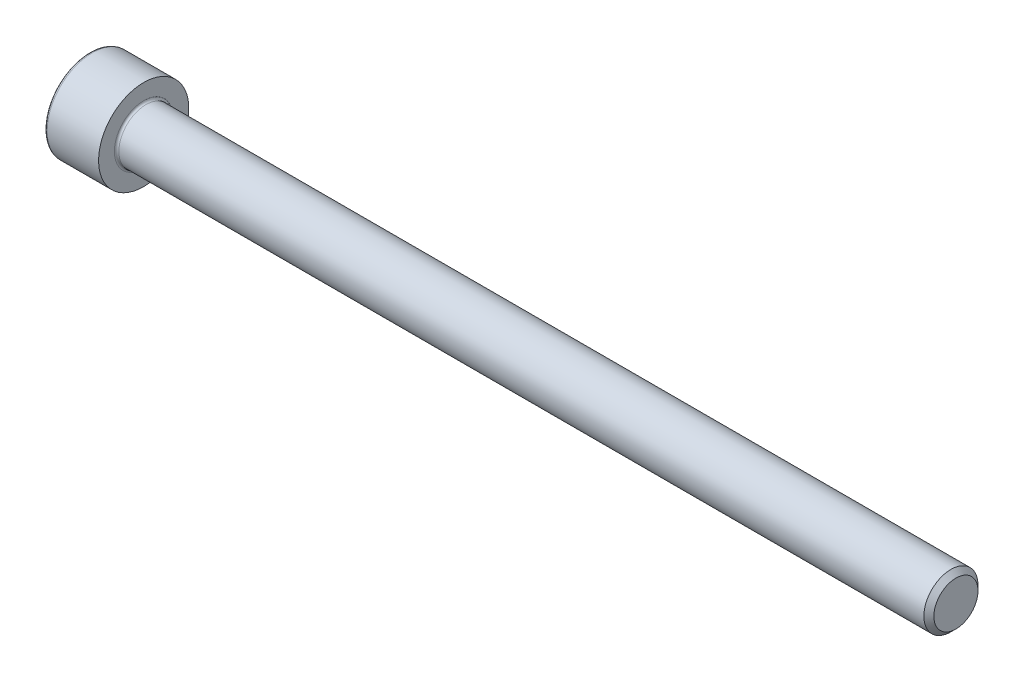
ISO-10303-21;
HEADER;
FILE_DESCRIPTION(('STEP AP214'),'2;1');
FILE_NAME('part.step','',(''),(''),'','','');
FILE_SCHEMA(('AUTOMOTIVE_DESIGN { 1 0 10303 214 1 1 1 1 }'));
ENDSEC;
DATA;
#1=APPLICATION_CONTEXT('core data for automotive mechanical design processes');
#2=APPLICATION_PROTOCOL_DEFINITION('international standard','automotive_design',2000,#1);
#3=PRODUCT_CONTEXT('',#1,'mechanical');
#4=PRODUCT('Part','Part','',(#3));
#5=PRODUCT_RELATED_PRODUCT_CATEGORY('part','',(#4));
#6=PRODUCT_DEFINITION_FORMATION('','',#4);
#7=PRODUCT_DEFINITION_CONTEXT('part definition',#1,'design');
#8=PRODUCT_DEFINITION('design','',#6,#7);
#9=PRODUCT_DEFINITION_SHAPE('','',#8);
#10=(LENGTH_UNIT() NAMED_UNIT(*) SI_UNIT(.MILLI.,.METRE.));
#11=(NAMED_UNIT(*) PLANE_ANGLE_UNIT() SI_UNIT($,.RADIAN.));
#12=(NAMED_UNIT(*) SI_UNIT($,.STERADIAN.) SOLID_ANGLE_UNIT());
#13=UNCERTAINTY_MEASURE_WITH_UNIT(LENGTH_MEASURE(1.E-05),#10,'distance_accuracy_value','');
#14=(GEOMETRIC_REPRESENTATION_CONTEXT(3) GLOBAL_UNCERTAINTY_ASSIGNED_CONTEXT((#13)) GLOBAL_UNIT_ASSIGNED_CONTEXT((#10,
#11,#12)) REPRESENTATION_CONTEXT('',''));
#15=CARTESIAN_POINT('',(0.,0.,0.));
#16=DIRECTION('',(0.,0.,1.));
#17=DIRECTION('',(1.,0.,0.));
#18=AXIS2_PLACEMENT_3D('',#15,#16,#17);
#19=CARTESIAN_POINT('',(0.,0.,0.));
#20=DIRECTION('',(-1.,0.,0.));
#21=DIRECTION('',(0.,0.,1.));
#22=AXIS2_PLACEMENT_3D('',#19,#20,#21);
#23=PLANE('',#22);
#24=DIRECTION('',(0.,-0.499999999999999,0.866025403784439));
#25=VECTOR('',#24,1.);
#26=CARTESIAN_POINT('',(0.,2.93524876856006,0.));
#27=LINE('',#26,#25);
#28=CARTESIAN_POINT('',(0.,2.93524876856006,0.));
#29=VERTEX_POINT('',#28);
#30=CARTESIAN_POINT('',(0.,1.46762438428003,2.542));
#31=VERTEX_POINT('',#30);
#32=EDGE_CURVE('E256',#29,#31,#27,.T.);
#33=ORIENTED_EDGE('',*,*,#32,.T.);
#34=DIRECTION('',(0.,1.,0.));
#35=VECTOR('',#34,1.);
#36=CARTESIAN_POINT('',(0.,-1.46762438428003,2.542));
#37=LINE('',#36,#35);
#38=CARTESIAN_POINT('',(0.,-1.46762438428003,2.542));
#39=VERTEX_POINT('',#38);
#40=EDGE_CURVE('E128',#39,#31,#37,.T.);
#41=ORIENTED_EDGE('',*,*,#40,.F.);
#42=DIRECTION('',(0.,-0.500000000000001,-0.866025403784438));
#43=VECTOR('',#42,1.);
#44=CARTESIAN_POINT('',(0.,-1.46762438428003,2.542));
#45=LINE('',#44,#43);
#46=CARTESIAN_POINT('',(0.,-2.93524876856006,0.));
#47=VERTEX_POINT('',#46);
#48=EDGE_CURVE('E259',#39,#47,#45,.T.);
#49=ORIENTED_EDGE('',*,*,#48,.T.);
#50=DIRECTION('',(0.,0.499999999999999,-0.866025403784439));
#51=VECTOR('',#50,1.);
#52=CARTESIAN_POINT('',(0.,-2.93524876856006,0.));
#53=LINE('',#52,#51);
#54=CARTESIAN_POINT('',(0.,-1.46762438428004,-2.542));
#55=VERTEX_POINT('',#54);
#56=EDGE_CURVE('E262',#47,#55,#53,.T.);
#57=ORIENTED_EDGE('',*,*,#56,.T.);
#58=DIRECTION('',(0.,-1.,0.));
#59=VECTOR('',#58,1.);
#60=CARTESIAN_POINT('',(0.,1.46762438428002,-2.54200000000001));
#61=LINE('',#60,#59);
#62=CARTESIAN_POINT('',(0.,1.46762438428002,-2.54200000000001));
#63=VERTEX_POINT('',#62);
#64=EDGE_CURVE('E265',#63,#55,#61,.T.);
#65=ORIENTED_EDGE('',*,*,#64,.F.);
#66=DIRECTION('',(0.,-0.500000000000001,-0.866025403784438));
#67=VECTOR('',#66,1.);
#68=CARTESIAN_POINT('',(0.,2.93524876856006,0.));
#69=LINE('',#68,#67);
#70=EDGE_CURVE('E123',#29,#63,#69,.T.);
#71=ORIENTED_EDGE('',*,*,#70,.F.);
#72=EDGE_LOOP('',(#33,#41,#49,#57,#65,#71));
#73=FACE_BOUND('',#72,.T.);
#74=CARTESIAN_POINT('',(0.,0.,0.));
#75=DIRECTION('',(-1.,0.,0.));
#76=DIRECTION('',(0.,0.,1.));
#77=AXIS2_PLACEMENT_3D('',#74,#75,#76);
#78=CIRCLE('',#77,4.7);
#79=CARTESIAN_POINT('',(0.,0.,4.7));
#80=VERTEX_POINT('',#79);
#81=EDGE_CURVE('E40',#80,#80,#78,.T.);
#82=ORIENTED_EDGE('',*,*,#81,.T.);
#83=EDGE_LOOP('',(#82));
#84=FACE_BOUND('',#83,.T.);
#85=ADVANCED_FACE('F32',(#73,#84),#23,.T.);
#86=CARTESIAN_POINT('',(-31.75,0.,0.));
#87=DIRECTION('',(-1.,0.,0.));
#88=DIRECTION('',(0.,0.,1.));
#89=AXIS2_PLACEMENT_3D('',#86,#87,#88);
#90=CYLINDRICAL_SURFACE('',#89,5.);
#91=CARTESIAN_POINT('',(0.300000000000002,0.,0.));
#92=DIRECTION('',(-1.,0.,0.));
#93=DIRECTION('',(0.,0.,1.));
#94=AXIS2_PLACEMENT_3D('',#91,#92,#93);
#95=CIRCLE('',#94,5.);
#96=CARTESIAN_POINT('',(0.300000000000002,0.,5.));
#97=VERTEX_POINT('',#96);
#98=EDGE_CURVE('E11',#97,#97,#95,.F.);
#99=ORIENTED_EDGE('',*,*,#98,.T.);
#100=EDGE_LOOP('',(#99));
#101=FACE_BOUND('',#100,.T.);
#102=CARTESIAN_POINT('',(6.,0.,0.));
#103=DIRECTION('',(-1.,0.,0.));
#104=DIRECTION('',(0.,0.,1.));
#105=AXIS2_PLACEMENT_3D('',#102,#103,#104);
#106=CIRCLE('',#105,5.);
#107=CARTESIAN_POINT('',(6.,0.,5.));
#108=VERTEX_POINT('',#107);
#109=EDGE_CURVE('E146',#108,#108,#106,.T.);
#110=ORIENTED_EDGE('',*,*,#109,.T.);
#111=EDGE_LOOP('',(#110));
#112=FACE_BOUND('',#111,.T.);
#113=ADVANCED_FACE('F170',(#101,#112),#90,.T.);
#114=CARTESIAN_POINT('',(6.,5.,0.));
#115=DIRECTION('',(1.,0.,0.));
#116=DIRECTION('',(0.,0.,-1.));
#117=AXIS2_PLACEMENT_3D('',#114,#115,#116);
#118=PLANE('',#117);
#119=CARTESIAN_POINT('',(6.,0.,0.));
#120=DIRECTION('',(1.,0.,0.));
#121=DIRECTION('',(0.,0.,-1.));
#122=AXIS2_PLACEMENT_3D('',#119,#120,#121);
#123=CIRCLE('',#122,3.24999999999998);
#124=CARTESIAN_POINT('',(6.,0.,-3.24999999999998));
#125=VERTEX_POINT('',#124);
#126=EDGE_CURVE('E149',#125,#125,#123,.F.);
#127=ORIENTED_EDGE('',*,*,#126,.T.);
#128=EDGE_LOOP('',(#127));
#129=FACE_BOUND('',#128,.T.);
#130=ORIENTED_EDGE('',*,*,#109,.F.);
#131=EDGE_LOOP('',(#130));
#132=FACE_BOUND('',#131,.T.);
#133=ADVANCED_FACE('F176',(#129,#132),#118,.T.);
#134=CARTESIAN_POINT('',(-31.75,0.,0.));
#135=DIRECTION('',(-1.,0.,0.));
#136=DIRECTION('',(0.,0.,1.));
#137=AXIS2_PLACEMENT_3D('',#134,#135,#136);
#138=CYLINDRICAL_SURFACE('',#137,2.99999999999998);
#139=CARTESIAN_POINT('',(6.25,0.,0.));
#140=DIRECTION('',(1.,0.,0.));
#141=DIRECTION('',(0.,0.,-1.));
#142=AXIS2_PLACEMENT_3D('',#139,#140,#141);
#143=CIRCLE('',#142,2.99999999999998);
#144=CARTESIAN_POINT('',(6.25,0.,-2.99999999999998));
#145=VERTEX_POINT('',#144);
#146=EDGE_CURVE('E152',#145,#145,#143,.T.);
#147=ORIENTED_EDGE('',*,*,#146,.T.);
#148=EDGE_LOOP('',(#147));
#149=FACE_BOUND('',#148,.T.);
#150=CARTESIAN_POINT('',(95.4455,0.,0.));
#151=DIRECTION('',(-1.,0.,0.));
#152=DIRECTION('',(0.,0.,1.));
#153=AXIS2_PLACEMENT_3D('',#150,#151,#152);
#154=CIRCLE('',#153,2.99999999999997);
#155=CARTESIAN_POINT('',(95.4455,0.,2.99999999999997));
#156=VERTEX_POINT('',#155);
#157=EDGE_CURVE('E143',#156,#156,#154,.T.);
#158=ORIENTED_EDGE('',*,*,#157,.T.);
#159=EDGE_LOOP('',(#158));
#160=FACE_BOUND('',#159,.T.);
#161=ADVANCED_FACE('F182',(#149,#160),#138,.T.);
#162=CARTESIAN_POINT('',(96.,0.,0.));
#163=DIRECTION('',(-1.,0.,0.));
#164=DIRECTION('',(0.,0.,1.));
#165=AXIS2_PLACEMENT_3D('',#162,#163,#164);
#166=CONICAL_SURFACE('',#165,2.4455,0.78539816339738);
#167=ORIENTED_EDGE('',*,*,#157,.F.);
#168=EDGE_LOOP('',(#167));
#169=FACE_BOUND('',#168,.T.);
#170=CARTESIAN_POINT('',(96.,0.,0.));
#171=DIRECTION('',(-1.,0.,0.));
#172=DIRECTION('',(0.,0.,1.));
#173=AXIS2_PLACEMENT_3D('',#170,#171,#172);
#174=CIRCLE('',#173,2.4455);
#175=CARTESIAN_POINT('',(96.,0.,2.4455));
#176=VERTEX_POINT('',#175);
#177=EDGE_CURVE('E139',#176,#176,#174,.T.);
#178=ORIENTED_EDGE('',*,*,#177,.T.);
#179=EDGE_LOOP('',(#178));
#180=FACE_BOUND('',#179,.T.);
#181=ADVANCED_FACE('F186',(#169,#180),#166,.T.);
#182=CARTESIAN_POINT('',(96.,2.4455,0.));
#183=DIRECTION('',(1.,0.,0.));
#184=DIRECTION('',(0.,0.,-1.));
#185=AXIS2_PLACEMENT_3D('',#182,#183,#184);
#186=PLANE('',#185);
#187=ORIENTED_EDGE('',*,*,#177,.F.);
#188=EDGE_LOOP('',(#187));
#189=FACE_BOUND('',#188,.T.);
#190=ADVANCED_FACE('F166',(#189),#186,.T.);
#191=CARTESIAN_POINT('',(6.25,0.,0.));
#192=DIRECTION('',(1.,0.,0.));
#193=DIRECTION('',(0.,0.,-1.));
#194=AXIS2_PLACEMENT_3D('',#191,#192,#193);
#195=TOROIDAL_SURFACE('',#194,3.24999999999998,0.25);
#196=ORIENTED_EDGE('',*,*,#146,.F.);
#197=EDGE_LOOP('',(#196));
#198=FACE_BOUND('',#197,.T.);
#199=ORIENTED_EDGE('',*,*,#126,.F.);
#200=EDGE_LOOP('',(#199));
#201=FACE_BOUND('',#200,.T.);
#202=ADVANCED_FACE('F159',(#198,#201),#195,.F.);
#203=CARTESIAN_POINT('',(0.300000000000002,0.,0.));
#204=DIRECTION('',(-1.,0.,0.));
#205=DIRECTION('',(0.,0.,1.));
#206=AXIS2_PLACEMENT_3D('',#203,#204,#205);
#207=TOROIDAL_SURFACE('',#206,4.7,0.3);
#208=ORIENTED_EDGE('',*,*,#98,.F.);
#209=EDGE_LOOP('',(#208));
#210=FACE_BOUND('',#209,.T.);
#211=ORIENTED_EDGE('',*,*,#81,.F.);
#212=EDGE_LOOP('',(#211));
#213=FACE_BOUND('',#212,.T.);
#214=ADVANCED_FACE('F34',(#210,#213),#207,.T.);
#215=CARTESIAN_POINT('',(3.,2.93524876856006,0.));
#216=DIRECTION('',(0.,-0.866025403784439,-0.499999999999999));
#217=DIRECTION('',(0.,0.499999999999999,-0.866025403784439));
#218=AXIS2_PLACEMENT_3D('',#215,#216,#217);
#219=PLANE('',#218);
#220=ORIENTED_EDGE('',*,*,#32,.F.);
#221=DIRECTION('',(-1.,0.,0.));
#222=VECTOR('',#221,1.);
#223=CARTESIAN_POINT('',(3.,2.93524876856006,0.));
#224=LINE('',#223,#222);
#225=CARTESIAN_POINT('',(3.,2.93524876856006,0.));
#226=VERTEX_POINT('',#225);
#227=EDGE_CURVE('E246',#226,#29,#224,.T.);
#228=ORIENTED_EDGE('',*,*,#227,.F.);
#229=DIRECTION('',(0.,-0.499999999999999,0.866025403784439));
#230=VECTOR('',#229,1.);
#231=CARTESIAN_POINT('',(3.,2.93524876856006,0.));
#232=LINE('',#231,#230);
#233=CARTESIAN_POINT('',(3.,2.20143657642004,1.271));
#234=VERTEX_POINT('',#233);
#235=EDGE_CURVE('E115',#226,#234,#232,.T.);
#236=ORIENTED_EDGE('',*,*,#235,.T.);
#237=CARTESIAN_POINT('',(3.,1.46762438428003,2.542));
#238=VERTEX_POINT('',#237);
#239=EDGE_CURVE('E106',#234,#238,#232,.T.);
#240=ORIENTED_EDGE('',*,*,#239,.T.);
#241=DIRECTION('',(-1.,0.,0.));
#242=VECTOR('',#241,1.);
#243=CARTESIAN_POINT('',(3.,1.46762438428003,2.542));
#244=LINE('',#243,#242);
#245=EDGE_CURVE('E120',#238,#31,#244,.T.);
#246=ORIENTED_EDGE('',*,*,#245,.T.);
#247=EDGE_LOOP('',(#220,#228,#236,#240,#246));
#248=FACE_BOUND('',#247,.T.);
#249=ADVANCED_FACE('F119',(#248),#219,.T.);
#250=CARTESIAN_POINT('',(3.,-1.46762438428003,2.542));
#251=DIRECTION('',(0.,0.,1.));
#252=DIRECTION('',(0.,-1.,0.));
#253=AXIS2_PLACEMENT_3D('',#250,#251,#252);
#254=PLANE('',#253);
#255=ORIENTED_EDGE('',*,*,#40,.T.);
#256=ORIENTED_EDGE('',*,*,#245,.F.);
#257=DIRECTION('',(0.,1.,0.));
#258=VECTOR('',#257,1.);
#259=CARTESIAN_POINT('',(3.,-1.46762438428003,2.542));
#260=LINE('',#259,#258);
#261=CARTESIAN_POINT('',(3.,0.,2.542));
#262=VERTEX_POINT('',#261);
#263=EDGE_CURVE('E103',#262,#238,#260,.T.);
#264=ORIENTED_EDGE('',*,*,#263,.F.);
#265=CARTESIAN_POINT('',(3.,-1.46762438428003,2.542));
#266=VERTEX_POINT('',#265);
#267=EDGE_CURVE('E114',#266,#262,#260,.T.);
#268=ORIENTED_EDGE('',*,*,#267,.F.);
#269=DIRECTION('',(-1.,0.,0.));
#270=VECTOR('',#269,1.);
#271=CARTESIAN_POINT('',(3.,-1.46762438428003,2.542));
#272=LINE('',#271,#270);
#273=EDGE_CURVE('E130',#266,#39,#272,.T.);
#274=ORIENTED_EDGE('',*,*,#273,.T.);
#275=EDGE_LOOP('',(#255,#256,#264,#268,#274));
#276=FACE_BOUND('',#275,.T.);
#277=ADVANCED_FACE('F125',(#276),#254,.F.);
#278=CARTESIAN_POINT('',(3.,-1.46762438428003,2.542));
#279=DIRECTION('',(0.,0.866025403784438,-0.500000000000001));
#280=DIRECTION('',(0.,0.500000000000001,0.866025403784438));
#281=AXIS2_PLACEMENT_3D('',#278,#279,#280);
#282=PLANE('',#281);
#283=ORIENTED_EDGE('',*,*,#48,.F.);
#284=ORIENTED_EDGE('',*,*,#273,.F.);
#285=DIRECTION('',(0.,-0.500000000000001,-0.866025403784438));
#286=VECTOR('',#285,1.);
#287=CARTESIAN_POINT('',(3.,-1.46762438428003,2.542));
#288=LINE('',#287,#286);
#289=CARTESIAN_POINT('',(3.,-2.20143657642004,1.271));
#290=VERTEX_POINT('',#289);
#291=EDGE_CURVE('E285',#266,#290,#288,.T.);
#292=ORIENTED_EDGE('',*,*,#291,.T.);
#293=CARTESIAN_POINT('',(3.,-2.93524876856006,0.));
#294=VERTEX_POINT('',#293);
#295=EDGE_CURVE('E274',#290,#294,#288,.T.);
#296=ORIENTED_EDGE('',*,*,#295,.T.);
#297=DIRECTION('',(-1.,0.,0.));
#298=VECTOR('',#297,1.);
#299=CARTESIAN_POINT('',(3.,-2.93524876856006,0.));
#300=LINE('',#299,#298);
#301=EDGE_CURVE('E135',#294,#47,#300,.T.);
#302=ORIENTED_EDGE('',*,*,#301,.T.);
#303=EDGE_LOOP('',(#283,#284,#292,#296,#302));
#304=FACE_BOUND('',#303,.T.);
#305=ADVANCED_FACE('F200',(#304),#282,.T.);
#306=CARTESIAN_POINT('',(3.,-2.93524876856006,0.));
#307=DIRECTION('',(0.,0.866025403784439,0.499999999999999));
#308=DIRECTION('',(0.,-0.499999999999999,0.866025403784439));
#309=AXIS2_PLACEMENT_3D('',#306,#307,#308);
#310=PLANE('',#309);
#311=ORIENTED_EDGE('',*,*,#56,.F.);
#312=ORIENTED_EDGE('',*,*,#301,.F.);
#313=DIRECTION('',(0.,0.499999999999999,-0.866025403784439));
#314=VECTOR('',#313,1.);
#315=CARTESIAN_POINT('',(3.,-2.93524876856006,0.));
#316=LINE('',#315,#314);
#317=CARTESIAN_POINT('',(3.,-2.20143657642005,-1.271));
#318=VERTEX_POINT('',#317);
#319=EDGE_CURVE('E252',#294,#318,#316,.T.);
#320=ORIENTED_EDGE('',*,*,#319,.T.);
#321=CARTESIAN_POINT('',(3.,-1.46762438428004,-2.542));
#322=VERTEX_POINT('',#321);
#323=EDGE_CURVE('E284',#318,#322,#316,.T.);
#324=ORIENTED_EDGE('',*,*,#323,.T.);
#325=DIRECTION('',(-1.,0.,0.));
#326=VECTOR('',#325,1.);
#327=CARTESIAN_POINT('',(3.,-1.46762438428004,-2.542));
#328=LINE('',#327,#326);
#329=EDGE_CURVE('E245',#322,#55,#328,.T.);
#330=ORIENTED_EDGE('',*,*,#329,.T.);
#331=EDGE_LOOP('',(#311,#312,#320,#324,#330));
#332=FACE_BOUND('',#331,.T.);
#333=ADVANCED_FACE('F203',(#332),#310,.T.);
#334=CARTESIAN_POINT('',(3.,1.46762438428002,-2.54200000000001));
#335=DIRECTION('',(0.,0.,-1.));
#336=DIRECTION('',(0.,1.,0.));
#337=AXIS2_PLACEMENT_3D('',#334,#335,#336);
#338=PLANE('',#337);
#339=ORIENTED_EDGE('',*,*,#64,.T.);
#340=ORIENTED_EDGE('',*,*,#329,.F.);
#341=DIRECTION('',(0.,-1.,0.));
#342=VECTOR('',#341,1.);
#343=CARTESIAN_POINT('',(3.,1.46762438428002,-2.54200000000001));
#344=LINE('',#343,#342);
#345=CARTESIAN_POINT('',(3.,0.,-2.542));
#346=VERTEX_POINT('',#345);
#347=EDGE_CURVE('E249',#346,#322,#344,.T.);
#348=ORIENTED_EDGE('',*,*,#347,.F.);
#349=CARTESIAN_POINT('',(3.,1.46762438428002,-2.54200000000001));
#350=VERTEX_POINT('',#349);
#351=EDGE_CURVE('E47',#350,#346,#344,.T.);
#352=ORIENTED_EDGE('',*,*,#351,.F.);
#353=DIRECTION('',(-1.,0.,0.));
#354=VECTOR('',#353,1.);
#355=CARTESIAN_POINT('',(3.,1.46762438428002,-2.54200000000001));
#356=LINE('',#355,#354);
#357=EDGE_CURVE('E242',#350,#63,#356,.T.);
#358=ORIENTED_EDGE('',*,*,#357,.T.);
#359=EDGE_LOOP('',(#339,#340,#348,#352,#358));
#360=FACE_BOUND('',#359,.T.);
#361=ADVANCED_FACE('F207',(#360),#338,.F.);
#362=CARTESIAN_POINT('',(3.,2.93524876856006,0.));
#363=DIRECTION('',(0.,0.866025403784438,-0.500000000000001));
#364=DIRECTION('',(0.,0.500000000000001,0.866025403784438));
#365=AXIS2_PLACEMENT_3D('',#362,#363,#364);
#366=PLANE('',#365);
#367=ORIENTED_EDGE('',*,*,#70,.T.);
#368=ORIENTED_EDGE('',*,*,#357,.F.);
#369=DIRECTION('',(0.,-0.500000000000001,-0.866025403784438));
#370=VECTOR('',#369,1.);
#371=CARTESIAN_POINT('',(3.,2.93524876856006,0.));
#372=LINE('',#371,#370);
#373=CARTESIAN_POINT('',(3.,2.20143657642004,-1.271));
#374=VERTEX_POINT('',#373);
#375=EDGE_CURVE('E232',#374,#350,#372,.T.);
#376=ORIENTED_EDGE('',*,*,#375,.F.);
#377=EDGE_CURVE('E238',#226,#374,#372,.T.);
#378=ORIENTED_EDGE('',*,*,#377,.F.);
#379=ORIENTED_EDGE('',*,*,#227,.T.);
#380=EDGE_LOOP('',(#367,#368,#376,#378,#379));
#381=FACE_BOUND('',#380,.T.);
#382=ADVANCED_FACE('F211',(#381),#366,.F.);
#383=CARTESIAN_POINT('',(3.,2.93524876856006,0.));
#384=DIRECTION('',(1.,0.,0.));
#385=DIRECTION('',(0.,0.,-1.));
#386=AXIS2_PLACEMENT_3D('',#383,#384,#385);
#387=PLANE('',#386);
#388=ORIENTED_EDGE('',*,*,#347,.T.);
#389=ORIENTED_EDGE('',*,*,#323,.F.);
#390=CARTESIAN_POINT('',(3.,0.,0.));
#391=DIRECTION('',(-1.,0.,0.));
#392=DIRECTION('',(0.,0.,1.));
#393=AXIS2_PLACEMENT_3D('',#390,#391,#392);
#394=CIRCLE('',#393,2.542);
#395=EDGE_CURVE('E280',#346,#318,#394,.T.);
#396=ORIENTED_EDGE('',*,*,#395,.F.);
#397=EDGE_LOOP('',(#388,#389,#396));
#398=FACE_BOUND('',#397,.T.);
#399=ADVANCED_FACE('F215',(#398),#387,.F.);
#400=ORIENTED_EDGE('',*,*,#319,.F.);
#401=ORIENTED_EDGE('',*,*,#295,.F.);
#402=EDGE_CURVE('E133',#318,#290,#394,.T.);
#403=ORIENTED_EDGE('',*,*,#402,.F.);
#404=EDGE_LOOP('',(#400,#401,#403));
#405=FACE_BOUND('',#404,.T.);
#406=ADVANCED_FACE('F218',(#405),#387,.F.);
#407=ORIENTED_EDGE('',*,*,#291,.F.);
#408=ORIENTED_EDGE('',*,*,#267,.T.);
#409=EDGE_CURVE('E129',#290,#262,#394,.T.);
#410=ORIENTED_EDGE('',*,*,#409,.F.);
#411=EDGE_LOOP('',(#407,#408,#410));
#412=FACE_BOUND('',#411,.T.);
#413=ADVANCED_FACE('F223',(#412),#387,.F.);
#414=ORIENTED_EDGE('',*,*,#263,.T.);
#415=ORIENTED_EDGE('',*,*,#239,.F.);
#416=EDGE_CURVE('E109',#262,#234,#394,.T.);
#417=ORIENTED_EDGE('',*,*,#416,.F.);
#418=EDGE_LOOP('',(#414,#415,#417));
#419=FACE_BOUND('',#418,.T.);
#420=ADVANCED_FACE('F105',(#419),#387,.F.);
#421=ORIENTED_EDGE('',*,*,#235,.F.);
#422=ORIENTED_EDGE('',*,*,#377,.T.);
#423=EDGE_CURVE('E140',#234,#374,#394,.T.);
#424=ORIENTED_EDGE('',*,*,#423,.F.);
#425=EDGE_LOOP('',(#421,#422,#424));
#426=FACE_BOUND('',#425,.T.);
#427=ADVANCED_FACE('F226',(#426),#387,.F.);
#428=ORIENTED_EDGE('',*,*,#375,.T.);
#429=ORIENTED_EDGE('',*,*,#351,.T.);
#430=EDGE_CURVE('E235',#374,#346,#394,.T.);
#431=ORIENTED_EDGE('',*,*,#430,.F.);
#432=EDGE_LOOP('',(#428,#429,#431));
#433=FACE_BOUND('',#432,.T.);
#434=ADVANCED_FACE('F196',(#433),#387,.F.);
#435=CARTESIAN_POINT('',(3.,0.,0.));
#436=DIRECTION('',(-1.,0.,0.));
#437=DIRECTION('',(0.,0.,1.));
#438=AXIS2_PLACEMENT_3D('',#435,#436,#437);
#439=CONICAL_SURFACE('',#438,2.542,1.04719755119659);
#440=CARTESIAN_POINT('',(4.46762438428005,0.,0.));
#441=VERTEX_POINT('',#440);
#442=VERTEX_LOOP('',#441);
#443=FACE_BOUND('',#442,.T.);
#444=ORIENTED_EDGE('',*,*,#416,.T.);
#445=ORIENTED_EDGE('',*,*,#423,.T.);
#446=ORIENTED_EDGE('',*,*,#430,.T.);
#447=ORIENTED_EDGE('',*,*,#395,.T.);
#448=ORIENTED_EDGE('',*,*,#402,.T.);
#449=ORIENTED_EDGE('',*,*,#409,.T.);
#450=EDGE_LOOP('',(#444,#445,#446,#447,#448,#449));
#451=FACE_BOUND('',#450,.T.);
#452=ADVANCED_FACE('F194',(#443,#451),#439,.F.);
#453=CLOSED_SHELL('',(#85,#113,#133,#161,#181,#190,#202,#214,#249,#277,#305,#333,#361,#382,#399,
#406,#413,#420,#427,#434,#452));
#454=MANIFOLD_SOLID_BREP('B2',#453);
#455=ADVANCED_BREP_SHAPE_REPRESENTATION('',(#18,#454),#14);
#456=SHAPE_DEFINITION_REPRESENTATION(#9,#455);
ENDSEC;
END-ISO-10303-21;
